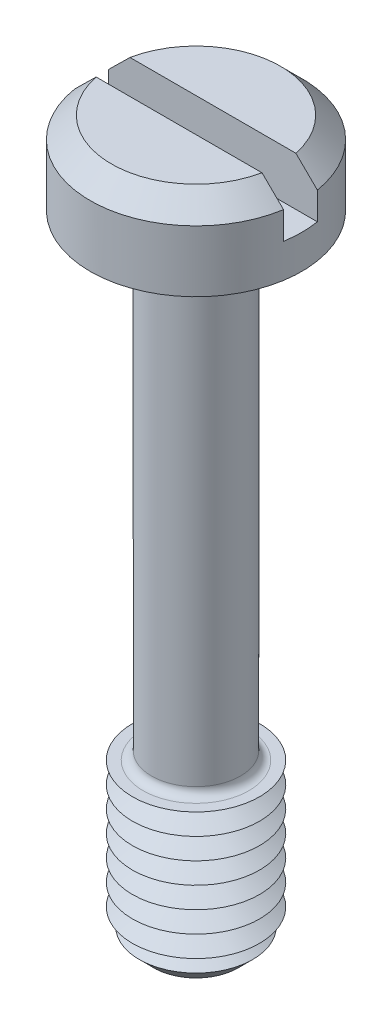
from build123d import *

# Parameters (mm, degrees)
SKETCH1_R           = 5
BOSS_EXTRUDE1_DEPTH = 3.9
SKETCH2_R           = 2.1
BOSS_EXTRUDE2_DEPTH = 30
SKETCH3_R           = 3
BOSS_EXTRUDE3_DEPTH = 7.5
CHAMFER1_SIZE       = 1
LPATTERN1_COUNT     = 7
LPATTERN1_PITCH     = 1
FILLET1_R           = 0.4
CHAMFER2_SIZE       = 1
SKETCH6_W           = 10
SKETCH6_H           = 1.6
CUT_EXTRUDE1_DEPTH  = 2.3


with BuildPart() as part:
    # Sketch1 → Boss-Extrude1 (new body)
    with BuildSketch(Plane(origin=(0, 0, 0), x_dir=(1, 0, 0), z_dir=(0, 1, 0))):
        with Locations(Location((0, 0, 0), (0, 0, 270))):
            Circle(SKETCH1_R)
    extrude(amount=BOSS_EXTRUDE1_DEPTH)

    # Sketch2 → Boss-Extrude2 (add)
    with BuildSketch(Plane.XZ):
        with Locations(Location((0, 0, 0), (0, 0, 270))):
            Circle(SKETCH2_R)
    extrude(amount=BOSS_EXTRUDE2_DEPTH)

    # Sketch3 → Boss-Extrude3 (add)
    with BuildSketch(Plane.XZ.offset(30)):
        with Locations(Location((0, 0, 0), (0, 0, 270))):
            Circle(SKETCH3_R)
    extrude(amount=-BOSS_EXTRUDE3_DEPTH)

    # Chamfer1
    chamfer1_edges = [part.edges().sort_by_distance(p)[0] for p in [
        (0, -30, 3),
    ]]
    chamfer(chamfer1_edges, length=CHAMFER1_SIZE)

    # Sketch5 → Cut-Revolve1 (revolve, cut)
    with BuildSketch(Plane(origin=(0, 0, 0), x_dir=(0, 0, -1), z_dir=(1, 0, 0))):
        Polygon((-3, -22.5), (-2.133974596, -23), (-3, -23.5), align=None)
    cut_revolve1 = revolve(axis=Axis((0, -6.58711856, 0), (0, -1, 0)), mode=Mode.SUBTRACT)

    # LPattern1: Cut-Revolve1 ×7
    with Locations(*[(0, -i * LPATTERN1_PITCH, 0) for i in range(1, LPATTERN1_COUNT)]):
        add(cut_revolve1, mode=Mode.SUBTRACT)

    # Fillet1
    fillet1_edges = [part.edges().sort_by_distance(p)[0] for p in [
        (0, 0, 2.1),
        (0, -22.5, 2.1),
    ]]
    fillet(fillet1_edges, radius=FILLET1_R)

    # Chamfer2
    chamfer2_edges = [part.edges().sort_by_distance(p)[0] for p in [
        (0, 3.9, -5),
    ]]
    chamfer(chamfer2_edges, length=CHAMFER2_SIZE)

    # Sketch6 → Cut-Extrude1 (cut)
    with BuildSketch(Plane(origin=(0, 3.9, 0), x_dir=(1, 0, 0), z_dir=(0, 1, 0))):
        Rectangle(SKETCH6_W, SKETCH6_H)
    extrude(amount=-CUT_EXTRUDE1_DEPTH, mode=Mode.SUBTRACT)


solid = part.part
